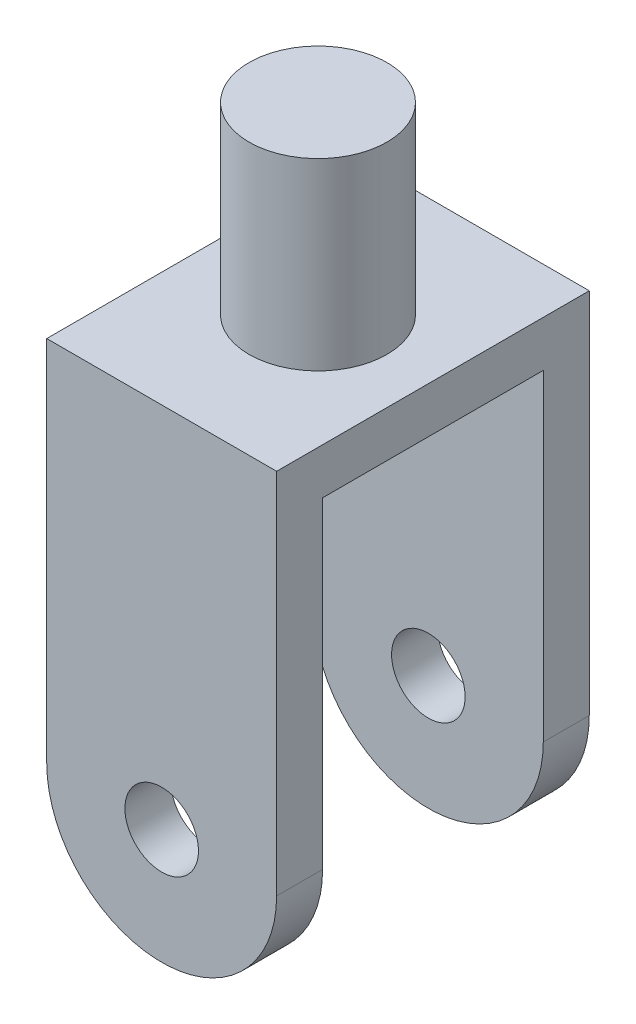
ISO-10303-21;
HEADER;
FILE_DESCRIPTION(('STEP AP214'),'2;1');
FILE_NAME('part.step','',(''),(''),'','','');
FILE_SCHEMA(('AUTOMOTIVE_DESIGN { 1 0 10303 214 1 1 1 1 }'));
ENDSEC;
DATA;
#1=APPLICATION_CONTEXT('core data for automotive mechanical design processes');
#2=APPLICATION_PROTOCOL_DEFINITION('international standard','automotive_design',2000,#1);
#3=PRODUCT_CONTEXT('',#1,'mechanical');
#4=PRODUCT('Part','Part','',(#3));
#5=PRODUCT_RELATED_PRODUCT_CATEGORY('part','',(#4));
#6=PRODUCT_DEFINITION_FORMATION('','',#4);
#7=PRODUCT_DEFINITION_CONTEXT('part definition',#1,'design');
#8=PRODUCT_DEFINITION('design','',#6,#7);
#9=PRODUCT_DEFINITION_SHAPE('','',#8);
#10=(LENGTH_UNIT() NAMED_UNIT(*) SI_UNIT(.MILLI.,.METRE.));
#11=(NAMED_UNIT(*) PLANE_ANGLE_UNIT() SI_UNIT($,.RADIAN.));
#12=(NAMED_UNIT(*) SI_UNIT($,.STERADIAN.) SOLID_ANGLE_UNIT());
#13=UNCERTAINTY_MEASURE_WITH_UNIT(LENGTH_MEASURE(1.E-05),#10,'distance_accuracy_value','');
#14=(GEOMETRIC_REPRESENTATION_CONTEXT(3) GLOBAL_UNCERTAINTY_ASSIGNED_CONTEXT((#13)) GLOBAL_UNIT_ASSIGNED_CONTEXT((#10,
#11,#12)) REPRESENTATION_CONTEXT('',''));
#15=CARTESIAN_POINT('',(0.,0.,0.));
#16=DIRECTION('',(0.,0.,1.));
#17=DIRECTION('',(1.,0.,0.));
#18=AXIS2_PLACEMENT_3D('',#15,#16,#17);
#19=CARTESIAN_POINT('',(31.75,0.,86.36));
#20=DIRECTION('',(0.,0.,-1.));
#21=DIRECTION('',(-1.,0.,0.));
#22=AXIS2_PLACEMENT_3D('',#19,#20,#21);
#23=CYLINDRICAL_SURFACE('',#22,31.75);
#24=DIRECTION('',(0.,0.,-1.));
#25=VECTOR('',#24,1.);
#26=CARTESIAN_POINT('',(63.5,0.,86.36));
#27=LINE('',#26,#25);
#28=CARTESIAN_POINT('',(63.5,0.,12.7));
#29=VERTEX_POINT('',#28);
#30=CARTESIAN_POINT('',(63.5,0.,0.));
#31=VERTEX_POINT('',#30);
#32=EDGE_CURVE('E209',#29,#31,#27,.T.);
#33=ORIENTED_EDGE('',*,*,#32,.F.);
#34=CARTESIAN_POINT('',(31.75,0.,12.7));
#35=DIRECTION('',(0.,0.,1.));
#36=DIRECTION('',(0.,-1.,0.));
#37=AXIS2_PLACEMENT_3D('',#34,#35,#36);
#38=CIRCLE('',#37,31.75);
#39=CARTESIAN_POINT('',(0.,0.,12.7));
#40=VERTEX_POINT('',#39);
#41=EDGE_CURVE('E160',#40,#29,#38,.T.);
#42=ORIENTED_EDGE('',*,*,#41,.F.);
#43=DIRECTION('',(0.,0.,-1.));
#44=VECTOR('',#43,1.);
#45=CARTESIAN_POINT('',(0.,0.,86.36));
#46=LINE('',#45,#44);
#47=CARTESIAN_POINT('',(0.,0.,0.));
#48=VERTEX_POINT('',#47);
#49=EDGE_CURVE('E94',#40,#48,#46,.T.);
#50=ORIENTED_EDGE('',*,*,#49,.T.);
#51=CARTESIAN_POINT('',(31.75,0.,0.));
#52=DIRECTION('',(0.,0.,1.));
#53=DIRECTION('',(1.,0.,0.));
#54=AXIS2_PLACEMENT_3D('',#51,#52,#53);
#55=CIRCLE('',#54,31.75);
#56=EDGE_CURVE('E174',#48,#31,#55,.T.);
#57=ORIENTED_EDGE('',*,*,#56,.T.);
#58=EDGE_LOOP('',(#33,#42,#50,#57));
#59=FACE_BOUND('',#58,.T.);
#60=ADVANCED_FACE('F45',(#59),#23,.T.);
#61=CARTESIAN_POINT('',(31.75,0.,86.36));
#62=DIRECTION('',(0.,0.,-1.));
#63=DIRECTION('',(-1.,0.,0.));
#64=AXIS2_PLACEMENT_3D('',#61,#62,#63);
#65=CYLINDRICAL_SURFACE('',#64,10.16);
#66=CARTESIAN_POINT('',(31.75,0.,0.));
#67=DIRECTION('',(0.,0.,1.));
#68=DIRECTION('',(1.,0.,0.));
#69=AXIS2_PLACEMENT_3D('',#66,#67,#68);
#70=CIRCLE('',#69,10.16);
#71=CARTESIAN_POINT('',(41.91,0.,0.));
#72=VERTEX_POINT('',#71);
#73=EDGE_CURVE('E169',#72,#72,#70,.T.);
#74=ORIENTED_EDGE('',*,*,#73,.F.);
#75=EDGE_LOOP('',(#74));
#76=FACE_BOUND('',#75,.T.);
#77=CARTESIAN_POINT('',(31.75,0.,12.7));
#78=DIRECTION('',(0.,0.,1.));
#79=DIRECTION('',(0.,-1.,0.));
#80=AXIS2_PLACEMENT_3D('',#77,#78,#79);
#81=CIRCLE('',#80,10.16);
#82=CARTESIAN_POINT('',(31.75,-10.16,12.7));
#83=VERTEX_POINT('',#82);
#84=EDGE_CURVE('E135',#83,#83,#81,.T.);
#85=ORIENTED_EDGE('',*,*,#84,.T.);
#86=EDGE_LOOP('',(#85));
#87=FACE_BOUND('',#86,.T.);
#88=ADVANCED_FACE('F215',(#76,#87),#65,.F.);
#89=CARTESIAN_POINT('',(31.75,0.,86.36));
#90=DIRECTION('',(0.,0.,1.));
#91=DIRECTION('',(1.,0.,0.));
#92=AXIS2_PLACEMENT_3D('',#89,#90,#91);
#93=PLANE('',#92);
#94=CARTESIAN_POINT('',(31.75,0.,86.36));
#95=DIRECTION('',(0.,0.,1.));
#96=DIRECTION('',(1.,0.,0.));
#97=AXIS2_PLACEMENT_3D('',#94,#95,#96);
#98=CIRCLE('',#97,31.75);
#99=CARTESIAN_POINT('',(0.,0.,86.36));
#100=VERTEX_POINT('',#99);
#101=CARTESIAN_POINT('',(63.5,0.,86.36));
#102=VERTEX_POINT('',#101);
#103=EDGE_CURVE('E178',#100,#102,#98,.T.);
#104=ORIENTED_EDGE('',*,*,#103,.T.);
#105=DIRECTION('',(0.,1.,0.));
#106=VECTOR('',#105,1.);
#107=CARTESIAN_POINT('',(63.5,0.,86.36));
#108=LINE('',#107,#106);
#109=CARTESIAN_POINT('',(63.5,101.6,86.36));
#110=VERTEX_POINT('',#109);
#111=EDGE_CURVE('E102',#102,#110,#108,.T.);
#112=ORIENTED_EDGE('',*,*,#111,.T.);
#113=DIRECTION('',(-1.,0.,0.));
#114=VECTOR('',#113,1.);
#115=CARTESIAN_POINT('',(0.,101.6,86.36));
#116=LINE('',#115,#114);
#117=CARTESIAN_POINT('',(0.,101.6,86.36));
#118=VERTEX_POINT('',#117);
#119=EDGE_CURVE('E184',#110,#118,#116,.T.);
#120=ORIENTED_EDGE('',*,*,#119,.T.);
#121=DIRECTION('',(0.,-1.,0.));
#122=VECTOR('',#121,1.);
#123=CARTESIAN_POINT('',(0.,0.,86.36));
#124=LINE('',#123,#122);
#125=EDGE_CURVE('E72',#118,#100,#124,.T.);
#126=ORIENTED_EDGE('',*,*,#125,.T.);
#127=EDGE_LOOP('',(#104,#112,#120,#126));
#128=FACE_BOUND('',#127,.T.);
#129=CARTESIAN_POINT('',(31.75,0.,86.36));
#130=DIRECTION('',(0.,0.,1.));
#131=DIRECTION('',(1.,0.,0.));
#132=AXIS2_PLACEMENT_3D('',#129,#130,#131);
#133=CIRCLE('',#132,10.16);
#134=CARTESIAN_POINT('',(41.91,0.,86.36));
#135=VERTEX_POINT('',#134);
#136=EDGE_CURVE('E170',#135,#135,#133,.T.);
#137=ORIENTED_EDGE('',*,*,#136,.F.);
#138=EDGE_LOOP('',(#137));
#139=FACE_BOUND('',#138,.T.);
#140=ADVANCED_FACE('F238',(#128,#139),#93,.T.);
#141=CARTESIAN_POINT('',(31.75,0.,0.));
#142=DIRECTION('',(0.,0.,1.));
#143=DIRECTION('',(1.,0.,0.));
#144=AXIS2_PLACEMENT_3D('',#141,#142,#143);
#145=PLANE('',#144);
#146=ORIENTED_EDGE('',*,*,#56,.F.);
#147=DIRECTION('',(0.,-1.,0.));
#148=VECTOR('',#147,1.);
#149=CARTESIAN_POINT('',(0.,0.,0.));
#150=LINE('',#149,#148);
#151=CARTESIAN_POINT('',(0.,101.6,0.));
#152=VERTEX_POINT('',#151);
#153=EDGE_CURVE('E181',#152,#48,#150,.T.);
#154=ORIENTED_EDGE('',*,*,#153,.F.);
#155=DIRECTION('',(-1.,0.,0.));
#156=VECTOR('',#155,1.);
#157=CARTESIAN_POINT('',(0.,101.6,0.));
#158=LINE('',#157,#156);
#159=CARTESIAN_POINT('',(63.5,101.6,0.));
#160=VERTEX_POINT('',#159);
#161=EDGE_CURVE('E194',#160,#152,#158,.T.);
#162=ORIENTED_EDGE('',*,*,#161,.F.);
#163=DIRECTION('',(0.,1.,0.));
#164=VECTOR('',#163,1.);
#165=CARTESIAN_POINT('',(63.5,0.,0.));
#166=LINE('',#165,#164);
#167=EDGE_CURVE('E191',#31,#160,#166,.T.);
#168=ORIENTED_EDGE('',*,*,#167,.F.);
#169=EDGE_LOOP('',(#146,#154,#162,#168));
#170=FACE_BOUND('',#169,.T.);
#171=ORIENTED_EDGE('',*,*,#73,.T.);
#172=EDGE_LOOP('',(#171));
#173=FACE_BOUND('',#172,.T.);
#174=ADVANCED_FACE('F240',(#170,#173),#145,.F.);
#175=CARTESIAN_POINT('',(31.75,0.,73.66));
#176=DIRECTION('',(0.,0.,1.));
#177=DIRECTION('',(0.,-1.,0.));
#178=AXIS2_PLACEMENT_3D('',#175,#176,#177);
#179=CIRCLE('',#178,31.75);
#180=CARTESIAN_POINT('',(0.,0.,73.66));
#181=VERTEX_POINT('',#180);
#182=CARTESIAN_POINT('',(63.5,0.,73.66));
#183=VERTEX_POINT('',#182);
#184=EDGE_CURVE('E140',#181,#183,#179,.T.);
#185=ORIENTED_EDGE('',*,*,#184,.T.);
#186=EDGE_CURVE('E55',#102,#183,#27,.T.);
#187=ORIENTED_EDGE('',*,*,#186,.F.);
#188=ORIENTED_EDGE('',*,*,#103,.F.);
#189=EDGE_CURVE('E199',#100,#181,#46,.T.);
#190=ORIENTED_EDGE('',*,*,#189,.T.);
#191=EDGE_LOOP('',(#185,#187,#188,#190));
#192=FACE_BOUND('',#191,.T.);
#193=ADVANCED_FACE('F47',(#192),#23,.T.);
#194=CARTESIAN_POINT('',(63.5,0.,86.36));
#195=DIRECTION('',(-1.,0.,0.));
#196=DIRECTION('',(0.,-1.,0.));
#197=AXIS2_PLACEMENT_3D('',#194,#195,#196);
#198=PLANE('',#197);
#199=ORIENTED_EDGE('',*,*,#186,.T.);
#200=DIRECTION('',(0.,1.,0.));
#201=VECTOR('',#200,1.);
#202=CARTESIAN_POINT('',(63.5,0.,73.66));
#203=LINE('',#202,#201);
#204=CARTESIAN_POINT('',(63.5,88.9,73.66));
#205=VERTEX_POINT('',#204);
#206=EDGE_CURVE('E163',#183,#205,#203,.T.);
#207=ORIENTED_EDGE('',*,*,#206,.T.);
#208=DIRECTION('',(0.,0.,1.));
#209=VECTOR('',#208,1.);
#210=CARTESIAN_POINT('',(63.5,88.9,86.36));
#211=LINE('',#210,#209);
#212=CARTESIAN_POINT('',(63.5,88.9,12.7));
#213=VERTEX_POINT('',#212);
#214=EDGE_CURVE('E130',#213,#205,#211,.T.);
#215=ORIENTED_EDGE('',*,*,#214,.F.);
#216=DIRECTION('',(0.,1.,0.));
#217=VECTOR('',#216,1.);
#218=CARTESIAN_POINT('',(63.5,0.,12.7));
#219=LINE('',#218,#217);
#220=EDGE_CURVE('E157',#29,#213,#219,.T.);
#221=ORIENTED_EDGE('',*,*,#220,.F.);
#222=ORIENTED_EDGE('',*,*,#32,.T.);
#223=ORIENTED_EDGE('',*,*,#167,.T.);
#224=DIRECTION('',(0.,0.,-1.));
#225=VECTOR('',#224,1.);
#226=CARTESIAN_POINT('',(63.5,101.6,86.36));
#227=LINE('',#226,#225);
#228=EDGE_CURVE('E205',#110,#160,#227,.T.);
#229=ORIENTED_EDGE('',*,*,#228,.F.);
#230=ORIENTED_EDGE('',*,*,#111,.F.);
#231=EDGE_LOOP('',(#199,#207,#215,#221,#222,#223,#229,#230));
#232=FACE_BOUND('',#231,.T.);
#233=ADVANCED_FACE('F223',(#232),#198,.F.);
#234=CARTESIAN_POINT('',(0.,101.6,86.36));
#235=DIRECTION('',(0.,-1.,0.));
#236=DIRECTION('',(0.,0.,-1.));
#237=AXIS2_PLACEMENT_3D('',#234,#235,#236);
#238=PLANE('',#237);
#239=CARTESIAN_POINT('',(31.75,101.6,43.18));
#240=DIRECTION('',(0.,1.,0.));
#241=DIRECTION('',(0.,0.,1.));
#242=AXIS2_PLACEMENT_3D('',#239,#240,#241);
#243=CIRCLE('',#242,19.05);
#244=CARTESIAN_POINT('',(31.75,101.6,62.23));
#245=VERTEX_POINT('',#244);
#246=EDGE_CURVE('E11',#245,#245,#243,.T.);
#247=ORIENTED_EDGE('',*,*,#246,.F.);
#248=EDGE_LOOP('',(#247));
#249=FACE_BOUND('',#248,.T.);
#250=ORIENTED_EDGE('',*,*,#161,.T.);
#251=DIRECTION('',(0.,0.,-1.));
#252=VECTOR('',#251,1.);
#253=CARTESIAN_POINT('',(0.,101.6,86.36));
#254=LINE('',#253,#252);
#255=EDGE_CURVE('E202',#118,#152,#254,.T.);
#256=ORIENTED_EDGE('',*,*,#255,.F.);
#257=ORIENTED_EDGE('',*,*,#119,.F.);
#258=ORIENTED_EDGE('',*,*,#228,.T.);
#259=EDGE_LOOP('',(#250,#256,#257,#258));
#260=FACE_BOUND('',#259,.T.);
#261=ADVANCED_FACE('F254',(#249,#260),#238,.F.);
#262=CARTESIAN_POINT('',(0.,0.,86.36));
#263=DIRECTION('',(1.,0.,0.));
#264=DIRECTION('',(0.,0.,-1.));
#265=AXIS2_PLACEMENT_3D('',#262,#263,#264);
#266=PLANE('',#265);
#267=DIRECTION('',(0.,0.,-1.));
#268=VECTOR('',#267,1.);
#269=CARTESIAN_POINT('',(0.,88.9,73.66));
#270=LINE('',#269,#268);
#271=CARTESIAN_POINT('',(0.,88.9,73.66));
#272=VERTEX_POINT('',#271);
#273=CARTESIAN_POINT('',(0.,88.9,12.7));
#274=VERTEX_POINT('',#273);
#275=EDGE_CURVE('E127',#272,#274,#270,.T.);
#276=ORIENTED_EDGE('',*,*,#275,.F.);
#277=DIRECTION('',(0.,-1.,0.));
#278=VECTOR('',#277,1.);
#279=CARTESIAN_POINT('',(0.,88.9,73.66));
#280=LINE('',#279,#278);
#281=EDGE_CURVE('E138',#272,#181,#280,.T.);
#282=ORIENTED_EDGE('',*,*,#281,.T.);
#283=ORIENTED_EDGE('',*,*,#189,.F.);
#284=ORIENTED_EDGE('',*,*,#125,.F.);
#285=ORIENTED_EDGE('',*,*,#255,.T.);
#286=ORIENTED_EDGE('',*,*,#153,.T.);
#287=ORIENTED_EDGE('',*,*,#49,.F.);
#288=DIRECTION('',(0.,-1.,0.));
#289=VECTOR('',#288,1.);
#290=CARTESIAN_POINT('',(0.,88.9,12.7));
#291=LINE('',#290,#289);
#292=EDGE_CURVE('E146',#274,#40,#291,.T.);
#293=ORIENTED_EDGE('',*,*,#292,.F.);
#294=EDGE_LOOP('',(#276,#282,#283,#284,#285,#286,#287,#293));
#295=FACE_BOUND('',#294,.T.);
#296=ADVANCED_FACE('F145',(#295),#266,.F.);
#297=CARTESIAN_POINT('',(31.75,0.,73.66));
#298=DIRECTION('',(0.,0.,1.));
#299=DIRECTION('',(0.,-1.,0.));
#300=AXIS2_PLACEMENT_3D('',#297,#298,#299);
#301=CIRCLE('',#300,10.16);
#302=CARTESIAN_POINT('',(31.75,-10.16,73.66));
#303=VERTEX_POINT('',#302);
#304=EDGE_CURVE('E49',#303,#303,#301,.T.);
#305=ORIENTED_EDGE('',*,*,#304,.F.);
#306=EDGE_LOOP('',(#305));
#307=FACE_BOUND('',#306,.T.);
#308=ORIENTED_EDGE('',*,*,#136,.T.);
#309=EDGE_LOOP('',(#308));
#310=FACE_BOUND('',#309,.T.);
#311=ADVANCED_FACE('F232',(#307,#310),#65,.F.);
#312=CARTESIAN_POINT('',(0.,88.9,73.66));
#313=DIRECTION('',(0.,-1.,0.));
#314=DIRECTION('',(0.,0.,-1.));
#315=AXIS2_PLACEMENT_3D('',#312,#313,#314);
#316=PLANE('',#315);
#317=ORIENTED_EDGE('',*,*,#214,.T.);
#318=DIRECTION('',(1.,0.,0.));
#319=VECTOR('',#318,1.);
#320=CARTESIAN_POINT('',(0.,88.9,73.66));
#321=LINE('',#320,#319);
#322=EDGE_CURVE('E123',#272,#205,#321,.T.);
#323=ORIENTED_EDGE('',*,*,#322,.F.);
#324=ORIENTED_EDGE('',*,*,#275,.T.);
#325=DIRECTION('',(1.,0.,0.));
#326=VECTOR('',#325,1.);
#327=CARTESIAN_POINT('',(0.,88.9,12.7));
#328=LINE('',#327,#326);
#329=EDGE_CURVE('E63',#274,#213,#328,.T.);
#330=ORIENTED_EDGE('',*,*,#329,.T.);
#331=EDGE_LOOP('',(#317,#323,#324,#330));
#332=FACE_BOUND('',#331,.T.);
#333=ADVANCED_FACE('F125',(#332),#316,.T.);
#334=CARTESIAN_POINT('',(0.,88.9,73.66));
#335=DIRECTION('',(0.,0.,1.));
#336=DIRECTION('',(0.,-1.,0.));
#337=AXIS2_PLACEMENT_3D('',#334,#335,#336);
#338=PLANE('',#337);
#339=ORIENTED_EDGE('',*,*,#304,.T.);
#340=EDGE_LOOP('',(#339));
#341=FACE_BOUND('',#340,.T.);
#342=ORIENTED_EDGE('',*,*,#281,.F.);
#343=ORIENTED_EDGE('',*,*,#322,.T.);
#344=ORIENTED_EDGE('',*,*,#206,.F.);
#345=ORIENTED_EDGE('',*,*,#184,.F.);
#346=EDGE_LOOP('',(#342,#343,#344,#345));
#347=FACE_BOUND('',#346,.T.);
#348=ADVANCED_FACE('F139',(#341,#347),#338,.F.);
#349=CARTESIAN_POINT('',(0.,88.9,12.7));
#350=DIRECTION('',(0.,0.,1.));
#351=DIRECTION('',(0.,-1.,0.));
#352=AXIS2_PLACEMENT_3D('',#349,#350,#351);
#353=PLANE('',#352);
#354=ORIENTED_EDGE('',*,*,#84,.F.);
#355=EDGE_LOOP('',(#354));
#356=FACE_BOUND('',#355,.T.);
#357=ORIENTED_EDGE('',*,*,#41,.T.);
#358=ORIENTED_EDGE('',*,*,#220,.T.);
#359=ORIENTED_EDGE('',*,*,#329,.F.);
#360=ORIENTED_EDGE('',*,*,#292,.T.);
#361=EDGE_LOOP('',(#357,#358,#359,#360));
#362=FACE_BOUND('',#361,.T.);
#363=ADVANCED_FACE('F217',(#356,#362),#353,.T.);
#364=CARTESIAN_POINT('',(31.75,152.4,43.18));
#365=DIRECTION('',(0.,-1.,0.));
#366=DIRECTION('',(0.,0.,-1.));
#367=AXIS2_PLACEMENT_3D('',#364,#365,#366);
#368=CYLINDRICAL_SURFACE('',#367,19.05);
#369=CARTESIAN_POINT('',(31.75,152.4,43.18));
#370=DIRECTION('',(0.,1.,0.));
#371=DIRECTION('',(0.,0.,1.));
#372=AXIS2_PLACEMENT_3D('',#369,#370,#371);
#373=CIRCLE('',#372,19.05);
#374=CARTESIAN_POINT('',(31.75,152.4,62.23));
#375=VERTEX_POINT('',#374);
#376=EDGE_CURVE('E152',#375,#375,#373,.T.);
#377=ORIENTED_EDGE('',*,*,#376,.F.);
#378=EDGE_LOOP('',(#377));
#379=FACE_BOUND('',#378,.T.);
#380=ORIENTED_EDGE('',*,*,#246,.T.);
#381=EDGE_LOOP('',(#380));
#382=FACE_BOUND('',#381,.T.);
#383=ADVANCED_FACE('F219',(#379,#382),#368,.T.);
#384=CARTESIAN_POINT('',(31.75,152.4,43.18));
#385=DIRECTION('',(0.,1.,0.));
#386=DIRECTION('',(0.,0.,1.));
#387=AXIS2_PLACEMENT_3D('',#384,#385,#386);
#388=PLANE('',#387);
#389=ORIENTED_EDGE('',*,*,#376,.T.);
#390=EDGE_LOOP('',(#389));
#391=FACE_BOUND('',#390,.T.);
#392=ADVANCED_FACE('F272',(#391),#388,.T.);
#393=CLOSED_SHELL('',(#60,#88,#140,#174,#193,#233,#261,#296,#311,#333,#348,#363,#383,#392));
#394=MANIFOLD_SOLID_BREP('B2',#393);
#395=ADVANCED_BREP_SHAPE_REPRESENTATION('',(#18,#394),#14);
#396=SHAPE_DEFINITION_REPRESENTATION(#9,#395);
ENDSEC;
END-ISO-10303-21;
